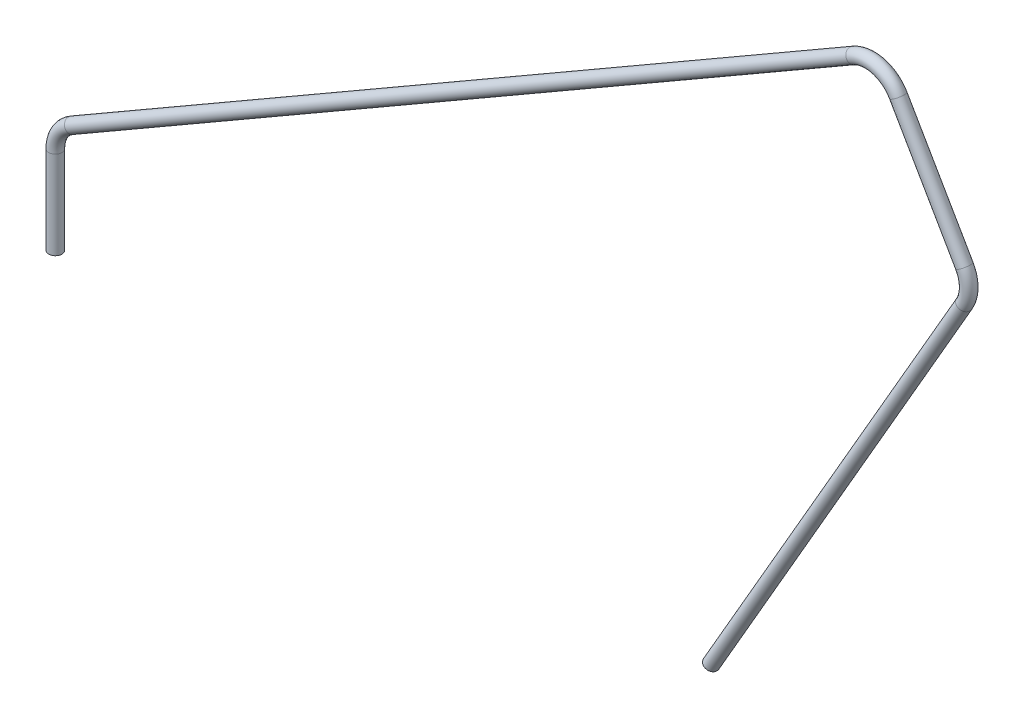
ISO-10303-21;
HEADER;
FILE_DESCRIPTION(('STEP AP214'),'2;1');
FILE_NAME('part.step','',(''),(''),'','','');
FILE_SCHEMA(('AUTOMOTIVE_DESIGN { 1 0 10303 214 1 1 1 1 }'));
ENDSEC;
DATA;
#1=APPLICATION_CONTEXT('core data for automotive mechanical design processes');
#2=APPLICATION_PROTOCOL_DEFINITION('international standard','automotive_design',2000,#1);
#3=PRODUCT_CONTEXT('',#1,'mechanical');
#4=PRODUCT('Part','Part','',(#3));
#5=PRODUCT_RELATED_PRODUCT_CATEGORY('part','',(#4));
#6=PRODUCT_DEFINITION_FORMATION('','',#4);
#7=PRODUCT_DEFINITION_CONTEXT('part definition',#1,'design');
#8=PRODUCT_DEFINITION('design','',#6,#7);
#9=PRODUCT_DEFINITION_SHAPE('','',#8);
#10=(LENGTH_UNIT() NAMED_UNIT(*) SI_UNIT(.MILLI.,.METRE.));
#11=(NAMED_UNIT(*) PLANE_ANGLE_UNIT() SI_UNIT($,.RADIAN.));
#12=(NAMED_UNIT(*) SI_UNIT($,.STERADIAN.) SOLID_ANGLE_UNIT());
#13=UNCERTAINTY_MEASURE_WITH_UNIT(LENGTH_MEASURE(1.E-05),#10,'distance_accuracy_value','');
#14=(GEOMETRIC_REPRESENTATION_CONTEXT(3) GLOBAL_UNCERTAINTY_ASSIGNED_CONTEXT((#13)) GLOBAL_UNIT_ASSIGNED_CONTEXT((#10,
#11,#12)) REPRESENTATION_CONTEXT('',''));
#15=CARTESIAN_POINT('',(0.,0.,0.));
#16=DIRECTION('',(0.,0.,1.));
#17=DIRECTION('',(1.,0.,0.));
#18=AXIS2_PLACEMENT_3D('',#15,#16,#17);
#19=CARTESIAN_POINT('',(0.,0.,0.));
#20=DIRECTION('',(0.,1.,0.));
#21=DIRECTION('',(0.,0.,1.));
#22=AXIS2_PLACEMENT_3D('',#19,#20,#21);
#23=PLANE('',#22);
#24=CARTESIAN_POINT('',(0.,0.,0.));
#25=DIRECTION('',(0.,1.,0.));
#26=DIRECTION('',(0.,0.,1.));
#27=AXIS2_PLACEMENT_3D('',#24,#25,#26);
#28=CIRCLE('',#27,3.);
#29=CARTESIAN_POINT('',(0.,0.,3.));
#30=VERTEX_POINT('',#29);
#31=EDGE_CURVE('E65',#30,#30,#28,.T.);
#32=ORIENTED_EDGE('',*,*,#31,.F.);
#33=EDGE_LOOP('',(#32));
#34=FACE_BOUND('',#33,.T.);
#35=ADVANCED_FACE('F37',(#34),#23,.F.);
#36=CARTESIAN_POINT('',(298.060796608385,-13.6473670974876,0.));
#37=DIRECTION('',(-0.500000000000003,-0.866025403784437,0.));
#38=DIRECTION('',(0.,0.,1.));
#39=AXIS2_PLACEMENT_3D('',#36,#37,#38);
#40=PLANE('',#39);
#41=CARTESIAN_POINT('',(298.060796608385,-13.6473670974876,0.));
#42=DIRECTION('',(-0.500000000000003,-0.866025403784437,0.));
#43=DIRECTION('',(0.,0.,1.));
#44=AXIS2_PLACEMENT_3D('',#41,#42,#43);
#45=CIRCLE('',#44,3.);
#46=CARTESIAN_POINT('',(298.060796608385,-13.6473670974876,3.));
#47=VERTEX_POINT('',#46);
#48=EDGE_CURVE('E10',#47,#47,#45,.T.);
#49=ORIENTED_EDGE('',*,*,#48,.T.);
#50=EDGE_LOOP('',(#49));
#51=FACE_BOUND('',#50,.T.);
#52=ADVANCED_FACE('F72',(#51),#40,.T.);
#53=CARTESIAN_POINT('',(0.,0.,0.));
#54=DIRECTION('',(0.,1.,0.));
#55=DIRECTION('',(0.,0.,1.));
#56=AXIS2_PLACEMENT_3D('',#53,#54,#55);
#57=CYLINDRICAL_SURFACE('',#56,3.);
#58=CARTESIAN_POINT('',(0.,40.,0.));
#59=DIRECTION('',(0.,1.,0.));
#60=DIRECTION('',(0.,0.,1.));
#61=AXIS2_PLACEMENT_3D('',#58,#59,#60);
#62=CIRCLE('',#61,3.);
#63=CARTESIAN_POINT('',(-3.,40.,0.));
#64=VERTEX_POINT('',#63);
#65=EDGE_CURVE('E62',#64,#64,#62,.T.);
#66=ORIENTED_EDGE('',*,*,#65,.F.);
#67=EDGE_LOOP('',(#66));
#68=FACE_BOUND('',#67,.T.);
#69=ORIENTED_EDGE('',*,*,#31,.T.);
#70=EDGE_LOOP('',(#69));
#71=FACE_BOUND('',#70,.T.);
#72=ADVANCED_FACE('F69',(#68,#71),#57,.T.);
#73=CARTESIAN_POINT('',(14.9999999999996,40.,0.));
#74=DIRECTION('',(0.,0.,-1.));
#75=DIRECTION('',(-1.,0.,0.));
#76=AXIS2_PLACEMENT_3D('',#73,#74,#75);
#77=TOROIDAL_SURFACE('',#76,14.9999999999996,3.);
#78=CARTESIAN_POINT('',(7.49999999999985,52.9903810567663,0.));
#79=DIRECTION('',(0.86602540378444,0.499999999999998,0.));
#80=DIRECTION('',(0.,0.,1.));
#81=AXIS2_PLACEMENT_3D('',#78,#79,#80);
#82=CIRCLE('',#81,3.);
#83=CARTESIAN_POINT('',(5.99999999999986,55.5884572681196,0.));
#84=VERTEX_POINT('',#83);
#85=EDGE_CURVE('E59',#84,#84,#82,.T.);
#86=CARTESIAN_POINT('',(14.9999999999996,40.,0.));
#87=DIRECTION('',(0.,0.,-1.));
#88=DIRECTION('',(-1.,0.,0.));
#89=AXIS2_PLACEMENT_3D('',#86,#87,#88);
#90=CIRCLE('',#89,17.9999999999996);
#91=EDGE_CURVE('',#64,#84,#90,.T.);
#92=ORIENTED_EDGE('',*,*,#65,.T.);
#93=ORIENTED_EDGE('',*,*,#85,.F.);
#94=ORIENTED_EDGE('',*,*,#91,.T.);
#95=ORIENTED_EDGE('',*,*,#91,.F.);
#96=EDGE_LOOP('',(#92,#94,#93,#95));
#97=FACE_BOUND('',#96,.T.);
#98=ADVANCED_FACE('F98',(#97),#77,.T.);
#99=CARTESIAN_POINT('',(7.49999999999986,52.9903810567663,0.));
#100=DIRECTION('',(0.86602540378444,0.499999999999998,0.));
#101=DIRECTION('',(-0.499999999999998,0.86602540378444,0.));
#102=AXIS2_PLACEMENT_3D('',#99,#100,#101);
#103=CYLINDRICAL_SURFACE('',#102,3.);
#104=CARTESIAN_POINT('',(362.57041555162,257.990381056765,0.));
#105=DIRECTION('',(0.86602540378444,0.499999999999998,0.));
#106=DIRECTION('',(0.,0.,1.));
#107=AXIS2_PLACEMENT_3D('',#104,#105,#106);
#108=CIRCLE('',#107,3.);
#109=CARTESIAN_POINT('',(361.07041555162,260.588457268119,0.));
#110=VERTEX_POINT('',#109);
#111=EDGE_CURVE('E56',#110,#110,#108,.T.);
#112=ORIENTED_EDGE('',*,*,#111,.F.);
#113=EDGE_LOOP('',(#112));
#114=FACE_BOUND('',#113,.T.);
#115=ORIENTED_EDGE('',*,*,#85,.T.);
#116=EDGE_LOOP('',(#115));
#117=FACE_BOUND('',#116,.T.);
#118=ADVANCED_FACE('F94',(#114,#117),#103,.T.);
#119=CARTESIAN_POINT('',(370.07041555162,244.999999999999,0.));
#120=DIRECTION('',(0.,0.,-1.));
#121=DIRECTION('',(-1.,0.,0.));
#122=AXIS2_PLACEMENT_3D('',#119,#120,#121);
#123=TOROIDAL_SURFACE('',#122,14.9999999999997,3.);
#124=CARTESIAN_POINT('',(383.060796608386,252.499999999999,0.));
#125=DIRECTION('',(0.500000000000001,-0.866025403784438,0.));
#126=DIRECTION('',(0.,0.,1.));
#127=AXIS2_PLACEMENT_3D('',#124,#125,#126);
#128=CIRCLE('',#127,3.);
#129=CARTESIAN_POINT('',(385.658872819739,253.999999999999,0.));
#130=VERTEX_POINT('',#129);
#131=EDGE_CURVE('E51',#130,#130,#128,.T.);
#132=CARTESIAN_POINT('',(370.07041555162,244.999999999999,0.));
#133=DIRECTION('',(0.,0.,-1.));
#134=DIRECTION('',(-1.,0.,0.));
#135=AXIS2_PLACEMENT_3D('',#132,#133,#134);
#136=CIRCLE('',#135,17.9999999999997);
#137=EDGE_CURVE('',#110,#130,#136,.T.);
#138=ORIENTED_EDGE('',*,*,#111,.T.);
#139=ORIENTED_EDGE('',*,*,#131,.F.);
#140=ORIENTED_EDGE('',*,*,#137,.T.);
#141=ORIENTED_EDGE('',*,*,#137,.F.);
#142=EDGE_LOOP('',(#138,#140,#139,#141));
#143=FACE_BOUND('',#142,.T.);
#144=ADVANCED_FACE('F90',(#143),#123,.T.);
#145=CARTESIAN_POINT('',(383.060796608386,252.499999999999,0.));
#146=DIRECTION('',(0.499999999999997,-0.86602540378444,0.));
#147=DIRECTION('',(0.86602540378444,0.499999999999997,0.));
#148=AXIS2_PLACEMENT_3D('',#145,#146,#147);
#149=CYLINDRICAL_SURFACE('',#148,3.);
#150=CARTESIAN_POINT('',(413.060796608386,200.538475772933,0.));
#151=DIRECTION('',(0.499999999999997,-0.86602540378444,0.));
#152=DIRECTION('',(0.,0.,1.));
#153=AXIS2_PLACEMENT_3D('',#150,#151,#152);
#154=CIRCLE('',#153,3.);
#155=CARTESIAN_POINT('',(415.658872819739,202.038475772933,0.));
#156=VERTEX_POINT('',#155);
#157=EDGE_CURVE('E47',#156,#156,#154,.T.);
#158=ORIENTED_EDGE('',*,*,#157,.F.);
#159=EDGE_LOOP('',(#158));
#160=FACE_BOUND('',#159,.T.);
#161=ORIENTED_EDGE('',*,*,#131,.T.);
#162=EDGE_LOOP('',(#161));
#163=FACE_BOUND('',#162,.T.);
#164=ADVANCED_FACE('F84',(#160,#163),#149,.T.);
#165=CARTESIAN_POINT('',(400.07041555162,193.038475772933,0.));
#166=DIRECTION('',(0.,0.,-1.));
#167=DIRECTION('',(-1.,0.,0.));
#168=AXIS2_PLACEMENT_3D('',#165,#166,#167);
#169=TOROIDAL_SURFACE('',#168,14.9999999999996,3.);
#170=CARTESIAN_POINT('',(413.060796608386,185.538475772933,0.));
#171=DIRECTION('',(-0.499999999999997,-0.86602540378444,0.));
#172=DIRECTION('',(0.,0.,1.));
#173=AXIS2_PLACEMENT_3D('',#170,#171,#172);
#174=CIRCLE('',#173,3.);
#175=CARTESIAN_POINT('',(415.658872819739,184.038475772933,0.));
#176=VERTEX_POINT('',#175);
#177=EDGE_CURVE('E43',#176,#176,#174,.T.);
#178=CARTESIAN_POINT('',(400.07041555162,193.038475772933,0.));
#179=DIRECTION('',(0.,0.,-1.));
#180=DIRECTION('',(-1.,0.,0.));
#181=AXIS2_PLACEMENT_3D('',#178,#179,#180);
#182=CIRCLE('',#181,17.9999999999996);
#183=EDGE_CURVE('',#156,#176,#182,.T.);
#184=ORIENTED_EDGE('',*,*,#157,.T.);
#185=ORIENTED_EDGE('',*,*,#177,.F.);
#186=ORIENTED_EDGE('',*,*,#183,.T.);
#187=ORIENTED_EDGE('',*,*,#183,.F.);
#188=EDGE_LOOP('',(#184,#186,#185,#187));
#189=FACE_BOUND('',#188,.T.);
#190=ADVANCED_FACE('F78',(#189),#169,.T.);
#191=CARTESIAN_POINT('',(413.060796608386,185.538475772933,0.));
#192=DIRECTION('',(-0.500000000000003,-0.866025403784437,0.));
#193=DIRECTION('',(0.866025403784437,-0.500000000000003,0.));
#194=AXIS2_PLACEMENT_3D('',#191,#192,#193);
#195=CYLINDRICAL_SURFACE('',#194,3.);
#196=ORIENTED_EDGE('',*,*,#48,.F.);
#197=EDGE_LOOP('',(#196));
#198=FACE_BOUND('',#197,.T.);
#199=ORIENTED_EDGE('',*,*,#177,.T.);
#200=EDGE_LOOP('',(#199));
#201=FACE_BOUND('',#200,.T.);
#202=ADVANCED_FACE('F76',(#198,#201),#195,.T.);
#203=CLOSED_SHELL('',(#35,#52,#72,#98,#118,#144,#164,#190,#202));
#204=MANIFOLD_SOLID_BREP('B2',#203);
#205=ADVANCED_BREP_SHAPE_REPRESENTATION('',(#18,#204),#14);
#206=SHAPE_DEFINITION_REPRESENTATION(#9,#205);
ENDSEC;
END-ISO-10303-21;
